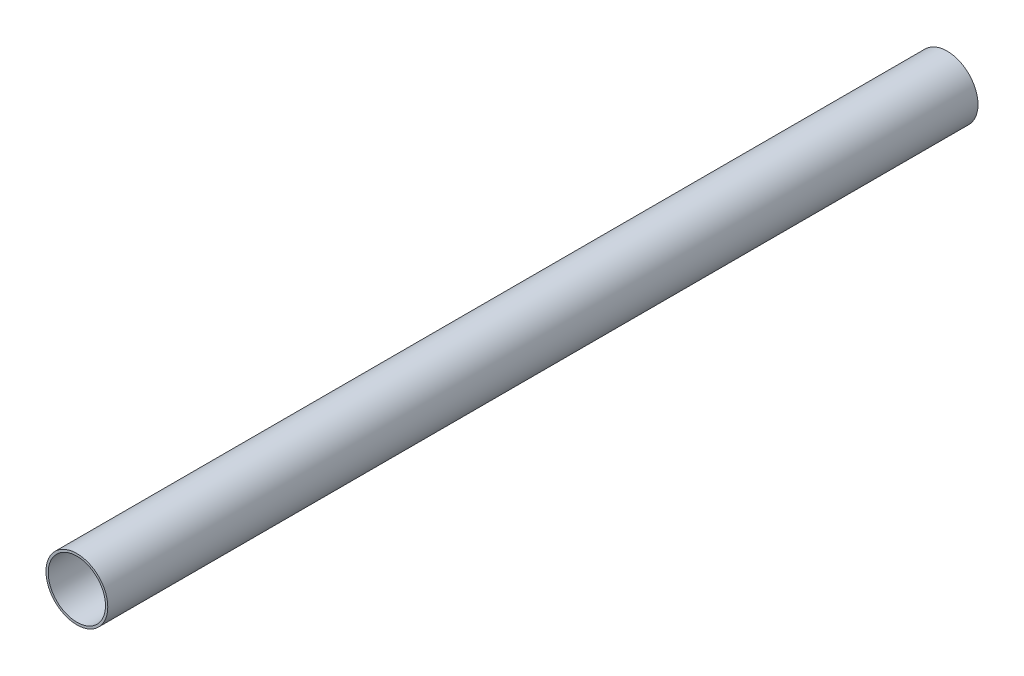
ISO-10303-21;
HEADER;
FILE_DESCRIPTION(('STEP AP214'),'2;1');
FILE_NAME('part.step','',(''),(''),'','','');
FILE_SCHEMA(('AUTOMOTIVE_DESIGN { 1 0 10303 214 1 1 1 1 }'));
ENDSEC;
DATA;
#1=APPLICATION_CONTEXT('core data for automotive mechanical design processes');
#2=APPLICATION_PROTOCOL_DEFINITION('international standard','automotive_design',2000,#1);
#3=PRODUCT_CONTEXT('',#1,'mechanical');
#4=PRODUCT('Part','Part','',(#3));
#5=PRODUCT_RELATED_PRODUCT_CATEGORY('part','',(#4));
#6=PRODUCT_DEFINITION_FORMATION('','',#4);
#7=PRODUCT_DEFINITION_CONTEXT('part definition',#1,'design');
#8=PRODUCT_DEFINITION('design','',#6,#7);
#9=PRODUCT_DEFINITION_SHAPE('','',#8);
#10=(LENGTH_UNIT() NAMED_UNIT(*) SI_UNIT(.MILLI.,.METRE.));
#11=(NAMED_UNIT(*) PLANE_ANGLE_UNIT() SI_UNIT($,.RADIAN.));
#12=(NAMED_UNIT(*) SI_UNIT($,.STERADIAN.) SOLID_ANGLE_UNIT());
#13=UNCERTAINTY_MEASURE_WITH_UNIT(LENGTH_MEASURE(1.E-05),#10,'distance_accuracy_value','');
#14=(GEOMETRIC_REPRESENTATION_CONTEXT(3) GLOBAL_UNCERTAINTY_ASSIGNED_CONTEXT((#13)) GLOBAL_UNIT_ASSIGNED_CONTEXT((#10,
#11,#12)) REPRESENTATION_CONTEXT('',''));
#15=CARTESIAN_POINT('',(0.,0.,0.));
#16=DIRECTION('',(0.,0.,1.));
#17=DIRECTION('',(1.,0.,0.));
#18=AXIS2_PLACEMENT_3D('',#15,#16,#17);
#19=CARTESIAN_POINT('',(0.,0.,380.));
#20=DIRECTION('',(0.,0.,1.));
#21=DIRECTION('',(1.,0.,0.));
#22=AXIS2_PLACEMENT_3D('',#19,#20,#21);
#23=PLANE('',#22);
#24=CARTESIAN_POINT('',(0.,0.,380.));
#25=DIRECTION('',(0.,0.,1.));
#26=DIRECTION('',(1.,0.,0.));
#27=AXIS2_PLACEMENT_3D('',#24,#25,#26);
#28=CIRCLE('',#27,27.);
#29=CARTESIAN_POINT('',(27.,0.,380.));
#30=VERTEX_POINT('',#29);
#31=EDGE_CURVE('E10',#30,#30,#28,.T.);
#32=ORIENTED_EDGE('',*,*,#31,.T.);
#33=EDGE_LOOP('',(#32));
#34=FACE_BOUND('',#33,.T.);
#35=CARTESIAN_POINT('',(0.,0.,380.));
#36=DIRECTION('',(0.,0.,1.));
#37=DIRECTION('',(1.,0.,0.));
#38=AXIS2_PLACEMENT_3D('',#35,#36,#37);
#39=CIRCLE('',#38,25.);
#40=CARTESIAN_POINT('',(25.,0.,380.));
#41=VERTEX_POINT('',#40);
#42=EDGE_CURVE('E45',#41,#41,#39,.T.);
#43=ORIENTED_EDGE('',*,*,#42,.F.);
#44=EDGE_LOOP('',(#43));
#45=FACE_BOUND('',#44,.T.);
#46=ADVANCED_FACE('F37',(#34,#45),#23,.T.);
#47=CARTESIAN_POINT('',(0.,0.,380.));
#48=DIRECTION('',(0.,0.,-1.));
#49=DIRECTION('',(-1.,0.,0.));
#50=AXIS2_PLACEMENT_3D('',#47,#48,#49);
#51=CYLINDRICAL_SURFACE('',#50,27.);
#52=ORIENTED_EDGE('',*,*,#31,.F.);
#53=EDGE_LOOP('',(#52));
#54=FACE_BOUND('',#53,.T.);
#55=CARTESIAN_POINT('',(0.,0.,-380.));
#56=DIRECTION('',(0.,0.,1.));
#57=DIRECTION('',(1.,0.,0.));
#58=AXIS2_PLACEMENT_3D('',#55,#56,#57);
#59=CIRCLE('',#58,27.);
#60=CARTESIAN_POINT('',(27.,0.,-380.));
#61=VERTEX_POINT('',#60);
#62=EDGE_CURVE('E50',#61,#61,#59,.T.);
#63=ORIENTED_EDGE('',*,*,#62,.T.);
#64=EDGE_LOOP('',(#63));
#65=FACE_BOUND('',#64,.T.);
#66=ADVANCED_FACE('F39',(#54,#65),#51,.T.);
#67=CARTESIAN_POINT('',(0.,0.,380.));
#68=DIRECTION('',(0.,0.,-1.));
#69=DIRECTION('',(-1.,0.,0.));
#70=AXIS2_PLACEMENT_3D('',#67,#68,#69);
#71=CYLINDRICAL_SURFACE('',#70,25.);
#72=ORIENTED_EDGE('',*,*,#42,.T.);
#73=EDGE_LOOP('',(#72));
#74=FACE_BOUND('',#73,.T.);
#75=CARTESIAN_POINT('',(0.,0.,-380.));
#76=DIRECTION('',(0.,0.,1.));
#77=DIRECTION('',(1.,0.,0.));
#78=AXIS2_PLACEMENT_3D('',#75,#76,#77);
#79=CIRCLE('',#78,25.);
#80=CARTESIAN_POINT('',(25.,0.,-380.));
#81=VERTEX_POINT('',#80);
#82=EDGE_CURVE('E55',#81,#81,#79,.T.);
#83=ORIENTED_EDGE('',*,*,#82,.F.);
#84=EDGE_LOOP('',(#83));
#85=FACE_BOUND('',#84,.T.);
#86=ADVANCED_FACE('F65',(#74,#85),#71,.F.);
#87=CARTESIAN_POINT('',(0.,0.,-380.));
#88=DIRECTION('',(0.,0.,1.));
#89=DIRECTION('',(1.,0.,0.));
#90=AXIS2_PLACEMENT_3D('',#87,#88,#89);
#91=PLANE('',#90);
#92=ORIENTED_EDGE('',*,*,#82,.T.);
#93=EDGE_LOOP('',(#92));
#94=FACE_BOUND('',#93,.T.);
#95=ORIENTED_EDGE('',*,*,#62,.F.);
#96=EDGE_LOOP('',(#95));
#97=FACE_BOUND('',#96,.T.);
#98=ADVANCED_FACE('F62',(#94,#97),#91,.F.);
#99=CLOSED_SHELL('',(#46,#66,#86,#98));
#100=MANIFOLD_SOLID_BREP('B2',#99);
#101=ADVANCED_BREP_SHAPE_REPRESENTATION('',(#18,#100),#14);
#102=SHAPE_DEFINITION_REPRESENTATION(#9,#101);
ENDSEC;
END-ISO-10303-21;
